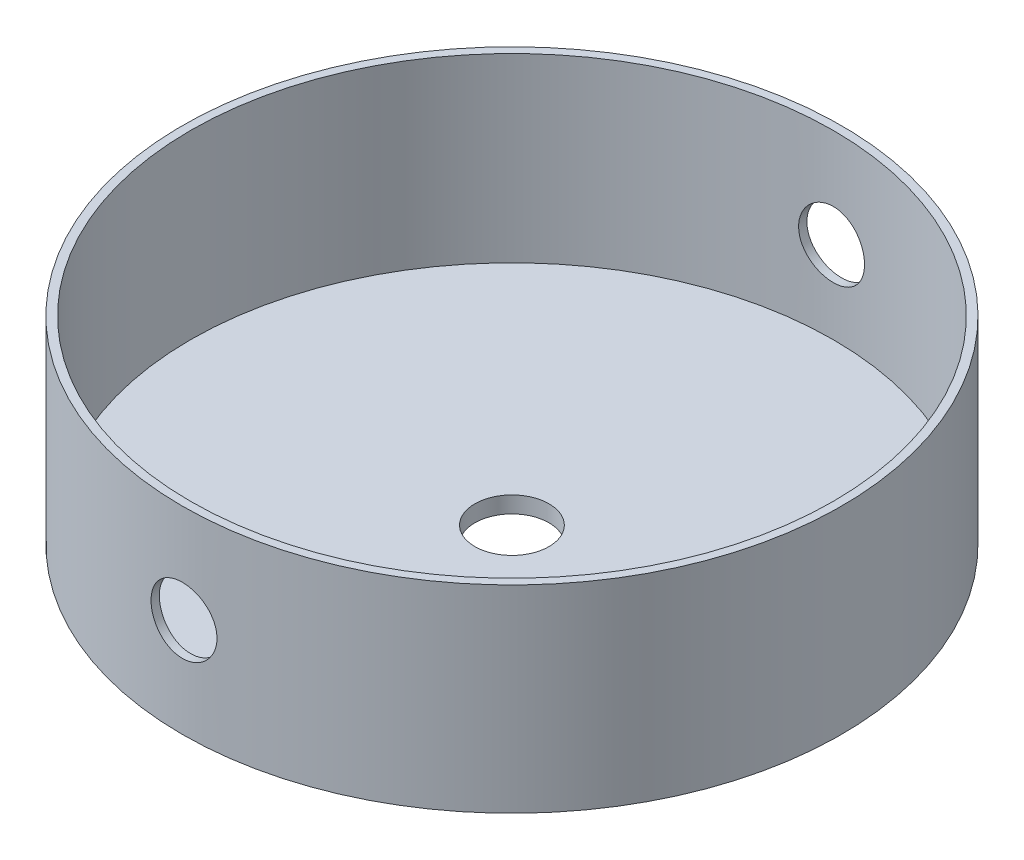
ISO-10303-21;
HEADER;
FILE_DESCRIPTION(('STEP AP214'),'2;1');
FILE_NAME('part.step','',(''),(''),'','','');
FILE_SCHEMA(('AUTOMOTIVE_DESIGN { 1 0 10303 214 1 1 1 1 }'));
ENDSEC;
DATA;
#1=APPLICATION_CONTEXT('core data for automotive mechanical design processes');
#2=APPLICATION_PROTOCOL_DEFINITION('international standard','automotive_design',2000,#1);
#3=PRODUCT_CONTEXT('',#1,'mechanical');
#4=PRODUCT('Part','Part','',(#3));
#5=PRODUCT_RELATED_PRODUCT_CATEGORY('part','',(#4));
#6=PRODUCT_DEFINITION_FORMATION('','',#4);
#7=PRODUCT_DEFINITION_CONTEXT('part definition',#1,'design');
#8=PRODUCT_DEFINITION('design','',#6,#7);
#9=PRODUCT_DEFINITION_SHAPE('','',#8);
#10=(LENGTH_UNIT() NAMED_UNIT(*) SI_UNIT(.MILLI.,.METRE.));
#11=(NAMED_UNIT(*) PLANE_ANGLE_UNIT() SI_UNIT($,.RADIAN.));
#12=(NAMED_UNIT(*) SI_UNIT($,.STERADIAN.) SOLID_ANGLE_UNIT());
#13=UNCERTAINTY_MEASURE_WITH_UNIT(LENGTH_MEASURE(1.E-05),#10,'distance_accuracy_value','');
#14=(GEOMETRIC_REPRESENTATION_CONTEXT(3) GLOBAL_UNCERTAINTY_ASSIGNED_CONTEXT((#13)) GLOBAL_UNIT_ASSIGNED_CONTEXT((#10,
#11,#12)) REPRESENTATION_CONTEXT('',''));
#15=CARTESIAN_POINT('',(0.,0.,0.));
#16=DIRECTION('',(0.,0.,1.));
#17=DIRECTION('',(1.,0.,0.));
#18=AXIS2_PLACEMENT_3D('',#15,#16,#17);
#19=CARTESIAN_POINT('',(0.,2.,0.));
#20=DIRECTION('',(0.,-1.,0.));
#21=DIRECTION('',(0.,0.,-1.));
#22=AXIS2_PLACEMENT_3D('',#19,#20,#21);
#23=CYLINDRICAL_SURFACE('',#22,40.);
#24=CARTESIAN_POINT('',(0.,16.,-40.));
#25=CARTESIAN_POINT('',(-0.224081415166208,15.9999902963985,-39.9999974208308));
#26=CARTESIAN_POINT('',(-0.448310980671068,15.9811069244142,-39.9980970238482));
#27=CARTESIAN_POINT('',(-0.890553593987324,15.9060625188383,-39.9906987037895));
#28=CARTESIAN_POINT('',(-1.10855951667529,15.8498604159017,-39.985196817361));
#29=CARTESIAN_POINT('',(-1.53188670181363,15.7018310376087,-39.9712165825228));
#30=CARTESIAN_POINT('',(-1.73721553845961,15.6100252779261,-39.9627400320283));
#31=CARTESIAN_POINT('',(-2.12950464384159,15.3934363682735,-39.9437582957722));
#32=CARTESIAN_POINT('',(-2.31646855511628,15.2686597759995,-39.9332535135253));
#33=CARTESIAN_POINT('',(-2.66743820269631,14.989189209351,-39.9113497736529));
#34=CARTESIAN_POINT('',(-2.83136857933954,14.8344008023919,-39.8999480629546));
#35=CARTESIAN_POINT('',(-3.1309700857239,14.4995018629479,-39.8775582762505));
#36=CARTESIAN_POINT('',(-3.26663990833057,14.3193901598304,-39.8665702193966));
#37=CARTESIAN_POINT('',(-3.50613588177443,13.9384858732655,-39.8462236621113));
#38=CARTESIAN_POINT('',(-3.6098938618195,13.7376502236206,-39.8368686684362));
#39=CARTESIAN_POINT('',(-3.782185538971,13.3212976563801,-39.820881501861));
#40=CARTESIAN_POINT('',(-3.8507201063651,13.1057811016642,-39.8142492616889));
#41=CARTESIAN_POINT('',(-3.95039616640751,12.666952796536,-39.8044833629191));
#42=CARTESIAN_POINT('',(-3.98166261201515,12.4436696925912,-39.8013380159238));
#43=CARTESIAN_POINT('',(-4.00630114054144,11.9950045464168,-39.798865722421));
#44=CARTESIAN_POINT('',(-3.9996742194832,11.7696225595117,-39.7995386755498));
#45=CARTESIAN_POINT('',(-3.94881712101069,11.3240187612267,-39.8046162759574));
#46=CARTESIAN_POINT('',(-3.90472337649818,11.1037812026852,-39.809007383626));
#47=CARTESIAN_POINT('',(-3.78039657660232,10.6738481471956,-39.8210053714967));
#48=CARTESIAN_POINT('',(-3.70016303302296,10.4641527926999,-39.8286122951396));
#49=CARTESIAN_POINT('',(-3.505683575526,10.0608256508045,-39.8462003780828));
#50=CARTESIAN_POINT('',(-3.39137713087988,9.86722324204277,-39.8561857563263));
#51=CARTESIAN_POINT('',(-3.13204010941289,9.50189914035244,-39.8774020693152));
#52=CARTESIAN_POINT('',(-2.98700863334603,9.33017808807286,-39.8886330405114));
#53=CARTESIAN_POINT('',(-2.66957644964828,9.01269842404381,-39.9111354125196));
#54=CARTESIAN_POINT('',(-2.49705791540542,8.86705759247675,-39.9224067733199));
#55=CARTESIAN_POINT('',(-2.1299579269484,8.60678546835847,-39.9436731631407));
#56=CARTESIAN_POINT('',(-1.93537644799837,8.49215421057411,-39.9536681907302));
#57=CARTESIAN_POINT('',(-1.52959242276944,8.29715991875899,-39.9712590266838));
#58=CARTESIAN_POINT('',(-1.31838698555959,8.21680286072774,-39.9788544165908));
#59=CARTESIAN_POINT('',(-0.885388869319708,8.09272433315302,-39.9907858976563));
#60=CARTESIAN_POINT('',(-0.663596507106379,8.04900176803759,-39.9951220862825));
#61=CARTESIAN_POINT('',(-0.216740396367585,7.99958276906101,-40.0000340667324));
#62=CARTESIAN_POINT('',(0.00830520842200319,7.99372380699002,-40.0006259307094));
#63=CARTESIAN_POINT('',(0.456175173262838,8.01977145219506,-39.9980256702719));
#64=CARTESIAN_POINT('',(0.678999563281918,8.05167754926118,-39.9948335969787));
#65=CARTESIAN_POINT('',(1.11563282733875,8.15221478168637,-39.9850344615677));
#66=CARTESIAN_POINT('',(1.32945939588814,8.22076981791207,-39.9784344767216));
#67=CARTESIAN_POINT('',(1.74257728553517,8.39258069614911,-39.9625599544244));
#68=CARTESIAN_POINT('',(1.9418682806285,8.49583731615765,-39.9532853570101));
#69=CARTESIAN_POINT('',(2.32099272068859,8.73452335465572,-39.9330590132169));
#70=CARTESIAN_POINT('',(2.50075863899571,8.87005955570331,-39.9221017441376));
#71=CARTESIAN_POINT('',(2.83504649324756,9.16930427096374,-39.8997573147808));
#72=CARTESIAN_POINT('',(2.98956779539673,9.33301349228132,-39.8883701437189));
#73=CARTESIAN_POINT('',(3.26954443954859,9.68466629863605,-39.8664009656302));
#74=CARTESIAN_POINT('',(3.39489311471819,9.87269502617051,-39.855822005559));
#75=CARTESIAN_POINT('',(3.61223303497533,10.2672294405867,-39.8367132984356));
#76=CARTESIAN_POINT('',(3.70422473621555,10.4737348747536,-39.8281835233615));
#77=CARTESIAN_POINT('',(3.85206083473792,10.8989949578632,-39.814157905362));
#78=CARTESIAN_POINT('',(3.90796869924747,11.1177273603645,-39.8086567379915));
#79=CARTESIAN_POINT('',(3.98225602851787,11.5615327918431,-39.8012946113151));
#80=CARTESIAN_POINT('',(4.00063656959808,11.7866056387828,-39.7994335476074));
#81=CARTESIAN_POINT('',(3.99933255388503,12.2356427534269,-39.7995645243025));
#82=CARTESIAN_POINT('',(3.97981555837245,12.4596075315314,-39.8015396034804));
#83=CARTESIAN_POINT('',(3.90362181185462,12.9010596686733,-39.8090841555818));
#84=CARTESIAN_POINT('',(3.84694501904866,13.118547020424,-39.8146536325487));
#85=CARTESIAN_POINT('',(3.69808674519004,13.5408693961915,-39.8287547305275));
#86=CARTESIAN_POINT('',(3.60591017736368,13.7457061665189,-39.8372859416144));
#87=CARTESIAN_POINT('',(3.38868621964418,14.1370275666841,-39.8563500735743));
#88=CARTESIAN_POINT('',(3.26363901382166,14.3235122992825,-39.866882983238));
#89=CARTESIAN_POINT('',(2.98359422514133,14.6736946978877,-39.8888194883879));
#90=CARTESIAN_POINT('',(2.82847179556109,14.8372923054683,-39.90022658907));
#91=CARTESIAN_POINT('',(2.49292679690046,15.1362089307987,-39.9225941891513));
#92=CARTESIAN_POINT('',(2.31249817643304,15.2715211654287,-39.933554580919));
#93=CARTESIAN_POINT('',(1.93096573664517,15.5102938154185,-39.9538224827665));
#94=CARTESIAN_POINT('',(1.72981099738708,15.6136731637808,-39.9631257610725));
#95=CARTESIAN_POINT('',(1.31303311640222,15.7850496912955,-39.9789851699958));
#96=CARTESIAN_POINT('',(1.09742659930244,15.8530867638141,-39.9855443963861));
#97=CARTESIAN_POINT('',(0.733833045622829,15.9348824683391,-39.9935285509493));
#98=CARTESIAN_POINT('',(0.588170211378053,15.9592681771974,-39.9959440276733));
#99=CARTESIAN_POINT('',(0.295026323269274,15.9918301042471,-39.9991805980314));
#100=CARTESIAN_POINT('',(0.147545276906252,16.0000063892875,-40.000001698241));
#101=CARTESIAN_POINT('',(0.,16.,-40.));
#102=B_SPLINE_CURVE_WITH_KNOTS('',3,(#24,#25,#26,#27,#28,#29,#30,#31,#32,#33,#34,#35,#36,#37,
#38,#39,#40,#41,#42,#43,#44,#45,#46,#47,#48,#49,#50,#51,#52,#53,#54,#55,#56,#57,#58,#59,#60,#61,
#62,#63,#64,#65,#66,#67,#68,#69,#70,#71,#72,#73,#74,#75,#76,#77,#78,#79,#80,#81,#82,#83,#84,#85,
#86,#87,#88,#89,#90,#91,#92,#93,#94,#95,#96,#97,#98,#99,#100,#101),.UNSPECIFIED.,.T.,.F.,(4,2,2,
2,2,2,2,2,2,2,2,2,2,2,2,2,2,2,2,2,2,2,2,2,2,2,2,2,2,2,2,2,2,2,2,2,2,2,4),(0.,0.671705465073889,
1.34415137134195,2.0161915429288,2.68809815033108,3.36215427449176,4.03624156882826,
4.71175901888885,5.3872597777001,6.06048928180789,6.73370109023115,7.40447189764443,
8.07525176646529,8.7472304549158,9.41922881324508,10.0941893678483,10.7691506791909,
11.4442296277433,12.1192883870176,12.7914475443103,13.4635976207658,14.1343574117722,
14.8051322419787,15.478157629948,16.1511999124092,16.8266657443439,17.5021223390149,
18.1763876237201,18.8506335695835,19.5219051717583,20.1931775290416,20.864357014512,
21.5355327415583,22.2095566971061,22.8837421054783,23.5596252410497,24.2347437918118,
24.6770266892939,25.119307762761),.UNSPECIFIED.);
#103=CARTESIAN_POINT('',(0.,16.,-40.));
#104=VERTEX_POINT('',#103);
#105=EDGE_CURVE('E92',#104,#104,#102,.T.);
#106=ORIENTED_EDGE('',*,*,#105,.T.);
#107=EDGE_LOOP('',(#106));
#108=FACE_BOUND('',#107,.T.);
#109=CARTESIAN_POINT('',(4.00000000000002,12.,39.7994974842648));
#110=CARTESIAN_POINT('',(3.99999029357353,11.7759217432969,39.7995001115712));
#111=CARTESIAN_POINT('',(3.98110743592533,11.5516953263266,39.8014102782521));
#112=CARTESIAN_POINT('',(3.9060652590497,11.1094592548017,39.8088435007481));
#113=CARTESIAN_POINT('',(3.84986485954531,10.8914567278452,39.8143705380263));
#114=CARTESIAN_POINT('',(3.70184046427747,10.4681367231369,39.8284053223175));
#115=CARTESIAN_POINT('',(3.61003806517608,10.2628116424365,39.8369112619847));
#116=CARTESIAN_POINT('',(3.39345706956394,9.87052883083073,39.8559432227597));
#117=CARTESIAN_POINT('',(3.26868502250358,9.68356746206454,39.8664688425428));
#118=CARTESIAN_POINT('',(2.98921904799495,9.33259494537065,39.8883970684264));
#119=CARTESIAN_POINT('',(2.83442967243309,9.16865996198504,39.8998024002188));
#120=CARTESIAN_POINT('',(2.49952686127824,8.86904956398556,39.9221802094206));
#121=CARTESIAN_POINT('',(2.31941226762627,8.73337544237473,39.9331526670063));
#122=CARTESIAN_POINT('',(1.93850544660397,8.49387497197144,39.9534553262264));
#123=CARTESIAN_POINT('',(1.73767065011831,8.39011600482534,39.9627820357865));
#124=CARTESIAN_POINT('',(1.32131993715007,8.2178222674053,39.9787126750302));
#125=CARTESIAN_POINT('',(1.10580437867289,8.14928663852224,39.9853166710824));
#126=CARTESIAN_POINT('',(0.666979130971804,8.04960836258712,39.9950386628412));
#127=CARTESIAN_POINT('',(0.443698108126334,8.01834066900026,39.9981683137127));
#128=CARTESIAN_POINT('',(-0.00496296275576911,7.99369892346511,40.0006286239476));
#129=CARTESIAN_POINT('',(-0.230342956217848,8.00032388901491,39.9999593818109));
#130=CARTESIAN_POINT('',(-0.675955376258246,8.05117789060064,39.9949068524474));
#131=CARTESIAN_POINT('',(-0.896203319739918,8.09527246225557,39.9905368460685));
#132=CARTESIAN_POINT('',(-1.32615671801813,8.21960451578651,39.9785891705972));
#133=CARTESIAN_POINT('',(-1.53586203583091,8.29984246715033,39.9710114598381));
#134=CARTESIAN_POINT('',(-1.93920125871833,8.49433105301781,39.9534774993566));
#135=CARTESIAN_POINT('',(-2.13280628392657,8.60864119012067,39.9435170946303));
#136=CARTESIAN_POINT('',(-2.49813405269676,8.86798609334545,39.9223353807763));
#137=CARTESIAN_POINT('',(-2.66985615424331,9.01302176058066,39.9111140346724));
#138=CARTESIAN_POINT('',(-2.98733108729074,9.3304569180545,39.8886117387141));
#139=CARTESIAN_POINT('',(-3.13296698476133,9.50297337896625,39.8773307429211));
#140=CARTESIAN_POINT('',(-3.3932301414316,9.87006746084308,39.8560295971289));
#141=CARTESIAN_POINT('',(-3.50785735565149,10.0646451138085,39.8460094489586));
#142=CARTESIAN_POINT('',(-3.70284873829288,10.4704281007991,39.828363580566));
#143=CARTESIAN_POINT('',(-3.78320568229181,10.6816369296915,39.8207383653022));
#144=CARTESIAN_POINT('',(-3.90728294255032,11.1146424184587,39.8087560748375));
#145=CARTESIAN_POINT('',(-3.95100437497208,11.3364387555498,39.8043989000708));
#146=CARTESIAN_POINT('',(-4.00041910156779,11.783296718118,39.7994632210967));
#147=CARTESIAN_POINT('',(-4.00627598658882,12.0083400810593,39.7988684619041));
#148=CARTESIAN_POINT('',(-3.98022498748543,12.4562050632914,39.8014820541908));
#149=CARTESIAN_POINT('',(-3.94831761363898,12.6790267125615,39.8046903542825));
#150=CARTESIAN_POINT('',(-3.84778069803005,13.1156463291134,39.8145337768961));
#151=CARTESIAN_POINT('',(-3.77922850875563,13.3294622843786,39.8211616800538));
#152=CARTESIAN_POINT('',(-3.60742687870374,13.7425602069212,39.8370916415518));
#153=CARTESIAN_POINT('',(-3.5041766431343,13.9418418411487,39.8463937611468));
#154=CARTESIAN_POINT('',(-3.26550000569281,14.3209598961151,39.8666633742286));
#155=CARTESIAN_POINT('',(-3.12996519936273,14.500727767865,39.8776364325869));
#156=CARTESIAN_POINT('',(-2.8307221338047,14.8350202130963,39.8999933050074));
#157=CARTESIAN_POINT('',(-2.66701317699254,14.9895441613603,39.9113771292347));
#158=CARTESIAN_POINT('',(-2.31535921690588,15.2695265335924,39.9333219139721));
#159=CARTESIAN_POINT('',(-2.12732902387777,15.3948782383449,39.943879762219));
#160=CARTESIAN_POINT('',(-1.73279086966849,15.6122234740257,39.9629376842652));
#161=CARTESIAN_POINT('',(-1.5262831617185,15.7042174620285,39.9714377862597));
#162=CARTESIAN_POINT('',(-1.10102450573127,15.8520550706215,39.9854084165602));
#163=CARTESIAN_POINT('',(-0.882296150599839,15.9079631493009,39.9908843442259));
#164=CARTESIAN_POINT('',(-0.438499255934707,15.9822522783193,39.998211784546));
#165=CARTESIAN_POINT('',(-0.213430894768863,16.000634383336,40.0000633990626));
#166=CARTESIAN_POINT('',(0.235608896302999,15.9993349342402,39.9999335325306));
#167=CARTESIAN_POINT('',(0.459580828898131,15.9798190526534,39.9979687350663));
#168=CARTESIAN_POINT('',(0.901047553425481,15.9036250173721,39.9904597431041));
#169=CARTESIAN_POINT('',(1.1185423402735,15.846946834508,39.9849155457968));
#170=CARTESIAN_POINT('',(1.54087963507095,15.6980829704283,39.9708689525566));
#171=CARTESIAN_POINT('',(1.74572386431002,15.6059021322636,39.962366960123));
#172=CARTESIAN_POINT('',(2.13705840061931,15.3886673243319,39.9433524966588));
#173=CARTESIAN_POINT('',(2.32354881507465,15.2636135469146,39.9328400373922));
#174=CARTESIAN_POINT('',(2.67373089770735,14.9835615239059,39.9109273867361));
#175=CARTESIAN_POINT('',(2.83732370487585,14.8284399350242,39.8995236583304));
#176=CARTESIAN_POINT('',(3.13623103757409,14.4928985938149,39.8771436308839));
#177=CARTESIAN_POINT('',(3.27153876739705,14.3124727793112,39.8661674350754));
#178=CARTESIAN_POINT('',(3.5103065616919,13.930942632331,39.8458553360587));
#179=CARTESIAN_POINT('',(3.6136847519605,13.7297868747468,39.8365236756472));
#180=CARTESIAN_POINT('',(3.78505883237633,13.3130068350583,39.8206077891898));
#181=CARTESIAN_POINT('',(3.85309463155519,13.0973991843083,39.8140204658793));
#182=CARTESIAN_POINT('',(3.93488675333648,12.7338090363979,39.806000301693));
#183=CARTESIAN_POINT('',(3.95927084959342,12.5881509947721,39.8035732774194));
#184=CARTESIAN_POINT('',(3.99183063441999,12.2950167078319,39.8003210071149));
#185=CARTESIAN_POINT('',(4.00000639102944,12.1475404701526,39.7994957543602));
#186=CARTESIAN_POINT('',(4.00000000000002,12.,39.7994974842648));
#187=B_SPLINE_CURVE_WITH_KNOTS('',3,(#109,#110,#111,#112,#113,#114,#115,#116,#117,#118,#119,
#120,#121,#122,#123,#124,#125,#126,#127,#128,#129,#130,#131,#132,#133,#134,#135,#136,#137,#138,
#139,#140,#141,#142,#143,#144,#145,#146,#147,#148,#149,#150,#151,#152,#153,#154,#155,#156,#157,
#158,#159,#160,#161,#162,#163,#164,#165,#166,#167,#168,#169,#170,#171,#172,#173,#174,#175,#176,
#177,#178,#179,#180,#181,#182,#183,#184,#185,#186),.UNSPECIFIED.,.T.,.F.,(4,2,2,2,2,2,2,2,2,2,2,
2,2,2,2,2,2,2,2,2,2,2,2,2,2,2,2,2,2,2,2,2,2,2,2,2,2,2,4),(0.,0.671695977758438,1.34413260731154,
2.01616196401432,2.68805792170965,3.36212646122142,4.03622583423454,4.71173879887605,
5.38723529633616,6.06045883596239,6.73366491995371,7.40446527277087,8.07527433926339,
8.74726181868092,9.41926900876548,10.0942170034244,10.7691659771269,11.4442571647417,
12.1193277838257,12.791479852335,13.4636228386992,14.1343525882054,14.8050977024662,
15.4781275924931,16.1511741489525,16.8266454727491,17.5021075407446,18.1763597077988,
18.8505929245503,19.5218853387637,20.1931782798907,20.8643796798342,21.5355771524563,
22.2095886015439,22.8837618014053,23.5596496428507,24.2347725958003,24.6770411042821,
25.1193077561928),.UNSPECIFIED.);
#188=CARTESIAN_POINT('',(4.00000000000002,12.,39.7994974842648));
#189=VERTEX_POINT('',#188);
#190=EDGE_CURVE('E86',#189,#189,#187,.T.);
#191=ORIENTED_EDGE('',*,*,#190,.T.);
#192=EDGE_LOOP('',(#191));
#193=FACE_BOUND('',#192,.T.);
#194=CARTESIAN_POINT('',(0.,0.,0.));
#195=DIRECTION('',(0.,1.,0.));
#196=DIRECTION('',(0.,0.,1.));
#197=AXIS2_PLACEMENT_3D('',#194,#195,#196);
#198=CIRCLE('',#197,40.);
#199=CARTESIAN_POINT('',(0.,0.,40.));
#200=VERTEX_POINT('',#199);
#201=EDGE_CURVE('E57',#200,#200,#198,.T.);
#202=ORIENTED_EDGE('',*,*,#201,.T.);
#203=EDGE_LOOP('',(#202));
#204=FACE_BOUND('',#203,.T.);
#205=CARTESIAN_POINT('',(0.,24.,0.));
#206=DIRECTION('',(0.,1.,0.));
#207=DIRECTION('',(0.,0.,1.));
#208=AXIS2_PLACEMENT_3D('',#205,#206,#207);
#209=CIRCLE('',#208,40.);
#210=CARTESIAN_POINT('',(0.,24.,40.));
#211=VERTEX_POINT('',#210);
#212=EDGE_CURVE('E62',#211,#211,#209,.T.);
#213=ORIENTED_EDGE('',*,*,#212,.F.);
#214=EDGE_LOOP('',(#213));
#215=FACE_BOUND('',#214,.T.);
#216=ADVANCED_FACE('F44',(#108,#193,#204,#215),#23,.T.);
#217=CARTESIAN_POINT('',(0.,0.,0.));
#218=DIRECTION('',(0.,1.,0.));
#219=DIRECTION('',(0.,0.,1.));
#220=AXIS2_PLACEMENT_3D('',#217,#218,#219);
#221=PLANE('',#220);
#222=CARTESIAN_POINT('',(0.,0.,0.));
#223=DIRECTION('',(0.,1.,0.));
#224=DIRECTION('',(0.,0.,1.));
#225=AXIS2_PLACEMENT_3D('',#222,#223,#224);
#226=CIRCLE('',#225,4.5);
#227=CARTESIAN_POINT('',(0.,0.,4.5));
#228=VERTEX_POINT('',#227);
#229=EDGE_CURVE('E70',#228,#228,#226,.T.);
#230=ORIENTED_EDGE('',*,*,#229,.T.);
#231=EDGE_LOOP('',(#230));
#232=FACE_BOUND('',#231,.T.);
#233=ORIENTED_EDGE('',*,*,#201,.F.);
#234=EDGE_LOOP('',(#233));
#235=FACE_BOUND('',#234,.T.);
#236=ADVANCED_FACE('F108',(#232,#235),#221,.F.);
#237=CARTESIAN_POINT('',(0.,24.,0.));
#238=DIRECTION('',(0.,1.,0.));
#239=DIRECTION('',(0.,0.,1.));
#240=AXIS2_PLACEMENT_3D('',#237,#238,#239);
#241=PLANE('',#240);
#242=ORIENTED_EDGE('',*,*,#212,.T.);
#243=EDGE_LOOP('',(#242));
#244=FACE_BOUND('',#243,.T.);
#245=CARTESIAN_POINT('',(0.,24.,0.));
#246=DIRECTION('',(0.,1.,0.));
#247=DIRECTION('',(0.,0.,1.));
#248=AXIS2_PLACEMENT_3D('',#245,#246,#247);
#249=CIRCLE('',#248,39.);
#250=CARTESIAN_POINT('',(0.,24.,39.));
#251=VERTEX_POINT('',#250);
#252=EDGE_CURVE('E99',#251,#251,#249,.T.);
#253=ORIENTED_EDGE('',*,*,#252,.F.);
#254=EDGE_LOOP('',(#253));
#255=FACE_BOUND('',#254,.T.);
#256=ADVANCED_FACE('F104',(#244,#255),#241,.T.);
#257=CARTESIAN_POINT('',(0.,24.,0.));
#258=DIRECTION('',(0.,-1.,0.));
#259=DIRECTION('',(0.,0.,-1.));
#260=AXIS2_PLACEMENT_3D('',#257,#258,#259);
#261=CYLINDRICAL_SURFACE('',#260,39.);
#262=CARTESIAN_POINT('',(0.,16.,-39.));
#263=CARTESIAN_POINT('',(-0.224050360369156,15.9999903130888,-38.9999973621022));
#264=CARTESIAN_POINT('',(-0.448248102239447,15.9811121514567,-38.9980487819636));
#265=CARTESIAN_POINT('',(-0.890425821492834,15.9060896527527,-38.9904628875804));
#266=CARTESIAN_POINT('',(-1.10839870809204,15.8499044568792,-38.9848215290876));
#267=CARTESIAN_POINT('',(-1.53165968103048,15.7019225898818,-38.9704867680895));
#268=CARTESIAN_POINT('',(-1.73695542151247,15.6101476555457,-38.96179522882));
#269=CARTESIAN_POINT('',(-2.12918477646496,15.3936341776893,-38.9423314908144));
#270=CARTESIAN_POINT('',(-2.31612198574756,15.2689021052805,-38.9315597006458));
#271=CARTESIAN_POINT('',(-2.66707784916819,14.9895098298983,-38.9090962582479));
#272=CARTESIAN_POINT('',(-2.8310174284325,14.8347505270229,-38.897401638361));
#273=CARTESIAN_POINT('',(-3.13064461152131,14.4999083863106,-38.8744350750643));
#274=CARTESIAN_POINT('',(-3.26633089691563,14.3198243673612,-38.8631631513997));
#275=CARTESIAN_POINT('',(-3.50588139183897,13.9389478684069,-38.8422880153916));
#276=CARTESIAN_POINT('',(-3.60967379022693,13.7381099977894,-38.8326885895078));
#277=CARTESIAN_POINT('',(-3.78203168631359,13.3217413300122,-38.8162823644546));
#278=CARTESIAN_POINT('',(-3.85059809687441,13.1062109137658,-38.8094754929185));
#279=CARTESIAN_POINT('',(-3.95032264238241,12.6673832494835,-38.7994520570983));
#280=CARTESIAN_POINT('',(-3.98161217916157,12.4441161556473,-38.7962228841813));
#281=CARTESIAN_POINT('',(-4.0063010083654,11.9954778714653,-38.793681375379));
#282=CARTESIAN_POINT('',(-3.99970134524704,11.7701067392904,-38.7943689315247));
#283=CARTESIAN_POINT('',(-3.94890737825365,11.3245645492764,-38.7995716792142));
#284=CARTESIAN_POINT('',(-3.90485666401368,11.1043769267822,-38.8040722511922));
#285=CARTESIAN_POINT('',(-3.78063451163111,10.6745365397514,-38.8163710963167));
#286=CARTESIAN_POINT('',(-3.70046256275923,10.4648839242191,-38.8241694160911));
#287=CARTESIAN_POINT('',(-3.50611561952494,10.0616119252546,-38.842201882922));
#288=CARTESIAN_POINT('',(-3.3918770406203,9.86802339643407,-38.8524405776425));
#289=CARTESIAN_POINT('',(-3.13268532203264,9.50271251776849,-38.8741963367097));
#290=CARTESIAN_POINT('',(-2.98773123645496,9.33099084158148,-38.8857134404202));
#291=CARTESIAN_POINT('',(-2.67042180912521,9.01345390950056,-38.9087934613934));
#292=CARTESIAN_POINT('',(-2.49794248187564,8.86776251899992,-38.9203563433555));
#293=CARTESIAN_POINT('',(-2.13090881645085,8.60738225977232,-38.9421746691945));
#294=CARTESIAN_POINT('',(-1.93635445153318,8.49269342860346,-38.9524301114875));
#295=CARTESIAN_POINT('',(-1.53060667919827,8.29757838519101,-38.9704816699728));
#296=CARTESIAN_POINT('',(-1.31941016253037,8.21715859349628,-38.9782773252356));
#297=CARTESIAN_POINT('',(-0.886414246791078,8.09295592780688,-38.9905262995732));
#298=CARTESIAN_POINT('',(-0.66461518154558,8.04917190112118,-38.9949797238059));
#299=CARTESIAN_POINT('',(-0.217782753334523,7.99964108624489,-39.0000289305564));
#300=CARTESIAN_POINT('',(0.007231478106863,7.99372340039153,-39.0006420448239));
#301=CARTESIAN_POINT('',(0.455048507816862,8.0196441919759,-38.9979880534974));
#302=CARTESIAN_POINT('',(0.677851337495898,8.05148213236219,-38.9947210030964));
#303=CARTESIAN_POINT('',(1.11442673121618,8.15186861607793,-38.9846848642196));
#304=CARTESIAN_POINT('',(1.32821791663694,8.22033700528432,-38.9779234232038));
#305=CARTESIAN_POINT('',(1.7412804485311,8.3919583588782,-38.9616568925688));
#306=CARTESIAN_POINT('',(1.94055145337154,8.49511213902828,-38.9521517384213));
#307=CARTESIAN_POINT('',(2.31968886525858,8.73359898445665,-38.9314174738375));
#308=CARTESIAN_POINT('',(2.49948441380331,8.86904417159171,-38.9201824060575));
#309=CARTESIAN_POINT('',(2.83384957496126,9.16810847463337,-38.8972677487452));
#310=CARTESIAN_POINT('',(2.98841852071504,9.33172833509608,-38.8855881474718));
#311=CARTESIAN_POINT('',(3.26853741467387,9.68324376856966,-38.8630485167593));
#312=CARTESIAN_POINT('',(3.39397509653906,9.87122904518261,-38.8521917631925));
#313=CARTESIAN_POINT('',(3.61149862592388,10.265697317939,-38.832577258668));
#314=CARTESIAN_POINT('',(3.70358494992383,10.4721800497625,-38.8238194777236));
#315=CARTESIAN_POINT('',(3.85160439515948,10.8973990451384,-38.809415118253));
#316=CARTESIAN_POINT('',(3.90760398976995,11.1161119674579,-38.8037628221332));
#317=CARTESIAN_POINT('',(3.98207589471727,11.5598973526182,-38.7961917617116));
#318=CARTESIAN_POINT('',(4.00054934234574,11.7849696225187,-38.7942728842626));
#319=CARTESIAN_POINT('',(3.99942830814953,12.2339687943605,-38.7943883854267));
#320=CARTESIAN_POINT('',(3.98001018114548,12.4578961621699,-38.7964044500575));
#321=CARTESIAN_POINT('',(3.90402731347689,12.8992894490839,-38.8041235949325));
#322=CARTESIAN_POINT('',(3.84746253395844,13.1167553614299,-38.8098266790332));
#323=CARTESIAN_POINT('',(3.69884130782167,13.5390492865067,-38.8242721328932));
#324=CARTESIAN_POINT('',(3.60679035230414,13.7438792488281,-38.8330140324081));
#325=CARTESIAN_POINT('',(3.38982782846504,14.1352100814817,-38.8525530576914));
#326=CARTESIAN_POINT('',(3.26491638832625,14.3217110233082,-38.8633501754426));
#327=CARTESIAN_POINT('',(2.98511694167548,14.6719934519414,-38.8858432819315));
#328=CARTESIAN_POINT('',(2.83009747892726,14.8356696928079,-38.8975430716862));
#329=CARTESIAN_POINT('',(2.4947445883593,15.1347621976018,-38.9204886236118));
#330=CARTESIAN_POINT('',(2.31440511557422,15.2701716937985,-38.931734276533));
#331=CARTESIAN_POINT('',(1.9330089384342,15.5091700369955,-38.9525354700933));
#332=CARTESIAN_POINT('',(1.7318989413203,15.6126741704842,-38.9620864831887));
#333=CARTESIAN_POINT('',(1.31518235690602,15.7843046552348,-38.9783734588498));
#334=CARTESIAN_POINT('',(1.09959236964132,15.852470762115,-38.9851125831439));
#335=CARTESIAN_POINT('',(0.73565932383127,15.9345553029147,-38.9933294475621));
#336=CARTESIAN_POINT('',(0.589640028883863,15.9590633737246,-38.9958191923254));
#337=CARTESIAN_POINT('',(0.295768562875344,15.9917888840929,-38.9991553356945));
#338=CARTESIAN_POINT('',(0.147916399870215,16.0000063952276,-39.0000017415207));
#339=CARTESIAN_POINT('',(0.,16.,-39.));
#340=B_SPLINE_CURVE_WITH_KNOTS('',3,(#262,#263,#264,#265,#266,#267,#268,#269,#270,#271,#272,
#273,#274,#275,#276,#277,#278,#279,#280,#281,#282,#283,#284,#285,#286,#287,#288,#289,#290,#291,
#292,#293,#294,#295,#296,#297,#298,#299,#300,#301,#302,#303,#304,#305,#306,#307,#308,#309,#310,
#311,#312,#313,#314,#315,#316,#317,#318,#319,#320,#321,#322,#323,#324,#325,#326,#327,#328,#329,
#330,#331,#332,#333,#334,#335,#336,#337,#338,#339),.UNSPECIFIED.,.T.,.F.,(4,2,2,2,2,2,2,2,2,2,2,
2,2,2,2,2,2,2,2,2,2,2,2,2,2,2,2,2,2,2,2,2,2,2,2,2,2,2,4),(0.,0.671610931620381,1.34395862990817,
2.01589633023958,2.6877021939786,3.36176416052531,4.03585757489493,4.71145781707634,
5.38704055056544,6.0602347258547,6.73341034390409,7.40401654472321,8.07463222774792,
8.74650751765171,9.41840350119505,10.0934161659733,10.7684296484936,11.4435695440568,
12.1186881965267,12.7907577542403,13.4628177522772,14.1334131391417,14.804024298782,
15.4769987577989,16.14999100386,16.8255353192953,17.5010699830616,18.1753566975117,
18.8496229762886,19.5207585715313,20.191894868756,20.8629273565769,21.533957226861,
22.2079855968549,22.8821751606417,23.5581396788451,24.2333420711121,24.6767366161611,
25.1201292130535),.UNSPECIFIED.);
#341=CARTESIAN_POINT('',(0.,16.,-39.));
#342=VERTEX_POINT('',#341);
#343=EDGE_CURVE('E48',#342,#342,#340,.T.);
#344=ORIENTED_EDGE('',*,*,#343,.F.);
#345=EDGE_LOOP('',(#344));
#346=FACE_BOUND('',#345,.T.);
#347=CARTESIAN_POINT('',(4.00000000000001,12.,38.7943294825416));
#348=CARTESIAN_POINT('',(3.9999903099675,11.7759531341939,38.7943321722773));
#349=CARTESIAN_POINT('',(3.98111271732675,11.5517588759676,38.7962912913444));
#350=CARTESIAN_POINT('',(3.9060926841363,11.1095883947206,38.8039148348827));
#351=CARTESIAN_POINT('',(3.8499093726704,10.8916192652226,38.8095833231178));
#352=CARTESIAN_POINT('',(3.7019330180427,10.4683662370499,38.823976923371));
#353=CARTESIAN_POINT('',(3.61016180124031,10.2630746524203,38.8327001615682));
#354=CARTESIAN_POINT('',(3.39365707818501,9.87085226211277,38.8522180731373));
#355=CARTESIAN_POINT('',(3.26893003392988,9.68391786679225,38.8630123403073));
#356=CARTESIAN_POINT('',(2.9895428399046,9.33295883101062,38.8855022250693));
#357=CARTESIAN_POINT('',(2.83478246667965,9.16901415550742,38.8972007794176));
#358=CARTESIAN_POINT('',(2.49993604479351,8.86937713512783,38.9201544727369));
#359=CARTESIAN_POINT('',(2.31984882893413,8.73368609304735,38.9314095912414));
#360=CARTESIAN_POINT('',(1.93896952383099,8.4941306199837,38.9522373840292));
#361=CARTESIAN_POINT('',(1.73813259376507,8.39033712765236,38.9618062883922));
#362=CARTESIAN_POINT('',(1.32176597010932,8.21797694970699,38.978151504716));
#363=CARTESIAN_POINT('',(1.10623665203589,8.14940936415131,38.9849278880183));
#364=CARTESIAN_POINT('',(0.667412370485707,8.04968236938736,38.9949039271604));
#365=CARTESIAN_POINT('',(0.444147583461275,8.01839145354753,38.9981161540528));
#366=CARTESIAN_POINT('',(-0.00448618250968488,7.99369906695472,39.0006447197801));
#367=CARTESIAN_POINT('',(-0.229855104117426,8.00029656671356,38.9999611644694));
#368=CARTESIAN_POINT('',(-0.675406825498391,8.05108710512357,38.9947854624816));
#369=CARTESIAN_POINT('',(-0.895605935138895,8.09513873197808,38.9903076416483));
#370=CARTESIAN_POINT('',(-1.32546882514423,8.21936668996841,38.9780630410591));
#371=CARTESIAN_POINT('',(-1.53513246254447,8.29954351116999,38.9702962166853));
#372=CARTESIAN_POINT('',(-1.93841783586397,8.49390055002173,38.952322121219));
#373=CARTESIAN_POINT('',(-2.13200926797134,8.60814321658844,38.942110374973));
#374=CARTESIAN_POINT('',(-2.49732422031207,8.86734366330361,38.9203919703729));
#375=CARTESIAN_POINT('',(-2.66904706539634,9.01230239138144,38.9088852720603));
#376=CARTESIAN_POINT('',(-2.98657876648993,9.32961511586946,38.8858054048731));
#377=CARTESIAN_POINT('',(-3.13226469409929,9.50209214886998,38.8742321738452));
#378=CARTESIAN_POINT('',(-3.39263502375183,9.86911927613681,38.8523764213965));
#379=CARTESIAN_POINT('',(-3.50731937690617,10.0636694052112,38.8420939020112));
#380=CARTESIAN_POINT('',(-3.70243119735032,10.4694160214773,38.8239829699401));
#381=CARTESIAN_POINT('',(-3.78285086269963,10.6806162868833,38.8161551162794));
#382=CARTESIAN_POINT('',(-3.90705212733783,11.1136203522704,38.803851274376));
#383=CARTESIAN_POINT('',(-3.95083490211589,11.3354238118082,38.7993751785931));
#384=CARTESIAN_POINT('',(-4.00036099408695,11.7822582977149,38.7943003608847));
#385=CARTESIAN_POINT('',(-4.00627638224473,12.0072700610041,38.7936840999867));
#386=CARTESIAN_POINT('',(-3.98035187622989,12.4550816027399,38.7963524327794));
#387=CARTESIAN_POINT('',(-3.94851251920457,12.6778814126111,38.7996369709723));
#388=CARTESIAN_POINT('',(-3.84812637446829,13.1144417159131,38.8097208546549));
#389=CARTESIAN_POINT('',(-3.77966112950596,13.3282211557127,38.8165123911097));
#390=CARTESIAN_POINT('',(-3.60804999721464,13.7412615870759,38.8328386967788));
#391=CARTESIAN_POINT('',(-3.5049032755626,13.9405222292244,38.8423735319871));
#392=CARTESIAN_POINT('',(-3.26642683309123,14.319652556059,38.8631545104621));
#393=CARTESIAN_POINT('',(-3.13098319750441,14.4994502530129,38.8744066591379));
#394=CARTESIAN_POINT('',(-2.8319207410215,14.833820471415,38.8973348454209));
#395=CARTESIAN_POINT('',(-2.668301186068,14.9883923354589,38.9090108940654));
#396=CARTESIAN_POINT('',(-2.31678448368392,15.2685175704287,38.931524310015));
#397=CARTESIAN_POINT('',(-2.12879757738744,15.3939586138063,38.9423583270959));
#398=CARTESIAN_POINT('',(-1.73432514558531,15.6114880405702,38.9619180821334));
#399=CARTESIAN_POINT('',(-1.52783988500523,15.7035769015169,38.9706438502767));
#400=CARTESIAN_POINT('',(-1.10262245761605,15.8515980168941,38.9849888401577));
#401=CARTESIAN_POINT('',(-0.88391401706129,15.9075978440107,38.9906138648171));
#402=CARTESIAN_POINT('',(-0.44013808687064,15.9820717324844,38.9981474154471));
#403=CARTESIAN_POINT('',(-0.215070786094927,16.00054690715,39.0000560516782));
#404=CARTESIAN_POINT('',(0.233931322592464,15.9994309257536,38.9999416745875));
#405=CARTESIAN_POINT('',(0.457866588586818,15.9800140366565,38.997936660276));
#406=CARTESIAN_POINT('',(0.899275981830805,15.904030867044,38.9902558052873));
#407=CARTESIAN_POINT('',(1.11675010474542,15.8474645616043,38.9845799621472));
#408=CARTESIAN_POINT('',(1.53906054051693,15.6988371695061,38.9701932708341));
#409=CARTESIAN_POINT('',(1.74389877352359,15.606781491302,38.9614828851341));
#410=CARTESIAN_POINT('',(2.13524417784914,15.3898069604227,38.9419974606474));
#411=CARTESIAN_POINT('',(2.32175142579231,15.2648882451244,38.9312224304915));
#412=CARTESIAN_POINT('',(2.67203353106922,14.9850807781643,38.9087551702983));
#413=CARTESIAN_POINT('',(2.8357044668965,14.8300622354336,38.8970591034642));
#414=CARTESIAN_POINT('',(3.13478669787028,14.4947133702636,38.8741003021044));
#415=CARTESIAN_POINT('',(3.27019121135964,14.3143769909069,38.8628376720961));
#416=CARTESIAN_POINT('',(3.50918417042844,13.9329833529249,38.8419888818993));
#417=CARTESIAN_POINT('',(3.61268701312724,13.7318722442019,38.8324072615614));
#418=CARTESIAN_POINT('',(3.78431477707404,13.315153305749,38.8160593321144));
#419=CARTESIAN_POINT('',(3.85247947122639,13.0995620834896,38.8092898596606));
#420=CARTESIAN_POINT('',(3.93456004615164,12.7356328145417,38.8010340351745));
#421=CARTESIAN_POINT('',(3.95906633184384,12.5896188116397,38.7985317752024));
#422=CARTESIAN_POINT('',(3.99178947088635,12.2957579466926,38.7951786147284));
#423=CARTESIAN_POINT('',(4.00000639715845,12.1479110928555,38.7943277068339));
#424=CARTESIAN_POINT('',(4.00000000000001,12.,38.7943294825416));
#425=B_SPLINE_CURVE_WITH_KNOTS('',3,(#347,#348,#349,#350,#351,#352,#353,#354,#355,#356,#357,
#358,#359,#360,#361,#362,#363,#364,#365,#366,#367,#368,#369,#370,#371,#372,#373,#374,#375,#376,
#377,#378,#379,#380,#381,#382,#383,#384,#385,#386,#387,#388,#389,#390,#391,#392,#393,#394,#395,
#396,#397,#398,#399,#400,#401,#402,#403,#404,#405,#406,#407,#408,#409,#410,#411,#412,#413,#414,
#415,#416,#417,#418,#419,#420,#421,#422,#423,#424),.UNSPECIFIED.,.T.,.F.,(4,2,2,2,2,2,2,2,2,2,2,
2,2,2,2,2,2,2,2,2,2,2,2,2,2,2,2,2,2,2,2,2,2,2,2,2,2,2,4),(0.,0.671600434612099,1.34393786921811,
2.01586360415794,2.68765768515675,3.3617333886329,4.03584016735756,4.71143545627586,
5.38701348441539,6.06020104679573,6.73337031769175,7.4040091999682,8.07465718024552,
8.74654221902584,9.41844799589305,10.0934467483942,10.7684465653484,11.4435999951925,
12.118731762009,12.7907935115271,13.4628456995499,14.1334078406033,14.803986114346,
15.4769655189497,16.149962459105,16.8255128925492,17.5010536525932,18.1753258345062,
18.8495780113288,19.5207365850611,20.1918956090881,20.8629523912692,21.5340063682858,
22.2080209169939,22.8821969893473,23.5581666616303,24.233373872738,24.6767525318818,
25.1201292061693),.UNSPECIFIED.);
#426=CARTESIAN_POINT('',(4.00000000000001,12.,38.7943294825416));
#427=VERTEX_POINT('',#426);
#428=EDGE_CURVE('E65',#427,#427,#425,.T.);
#429=ORIENTED_EDGE('',*,*,#428,.F.);
#430=EDGE_LOOP('',(#429));
#431=FACE_BOUND('',#430,.T.);
#432=ORIENTED_EDGE('',*,*,#252,.T.);
#433=EDGE_LOOP('',(#432));
#434=FACE_BOUND('',#433,.T.);
#435=CARTESIAN_POINT('',(0.,2.,0.));
#436=DIRECTION('',(0.,1.,0.));
#437=DIRECTION('',(0.,0.,1.));
#438=AXIS2_PLACEMENT_3D('',#435,#436,#437);
#439=CIRCLE('',#438,39.);
#440=CARTESIAN_POINT('',(0.,2.,39.));
#441=VERTEX_POINT('',#440);
#442=EDGE_CURVE('E12',#441,#441,#439,.F.);
#443=ORIENTED_EDGE('',*,*,#442,.T.);
#444=EDGE_LOOP('',(#443));
#445=FACE_BOUND('',#444,.T.);
#446=ADVANCED_FACE('F71',(#346,#431,#434,#445),#261,.F.);
#447=CARTESIAN_POINT('',(0.,2.,0.));
#448=DIRECTION('',(0.,1.,0.));
#449=DIRECTION('',(0.,0.,1.));
#450=AXIS2_PLACEMENT_3D('',#447,#448,#449);
#451=PLANE('',#450);
#452=CARTESIAN_POINT('',(0.,2.,0.));
#453=DIRECTION('',(0.,1.,0.));
#454=DIRECTION('',(0.,0.,1.));
#455=AXIS2_PLACEMENT_3D('',#452,#453,#454);
#456=CIRCLE('',#455,4.5);
#457=CARTESIAN_POINT('',(0.,2.,4.5));
#458=VERTEX_POINT('',#457);
#459=EDGE_CURVE('E172',#458,#458,#456,.T.);
#460=ORIENTED_EDGE('',*,*,#459,.F.);
#461=EDGE_LOOP('',(#460));
#462=FACE_BOUND('',#461,.T.);
#463=ORIENTED_EDGE('',*,*,#442,.F.);
#464=EDGE_LOOP('',(#463));
#465=FACE_BOUND('',#464,.T.);
#466=ADVANCED_FACE('F122',(#462,#465),#451,.T.);
#467=CARTESIAN_POINT('',(0.,12.,-40.));
#468=DIRECTION('',(0.,0.,1.));
#469=DIRECTION('',(1.,0.,0.));
#470=AXIS2_PLACEMENT_3D('',#467,#468,#469);
#471=CYLINDRICAL_SURFACE('',#470,4.);
#472=ORIENTED_EDGE('',*,*,#428,.T.);
#473=EDGE_LOOP('',(#472));
#474=FACE_BOUND('',#473,.T.);
#475=ORIENTED_EDGE('',*,*,#190,.F.);
#476=EDGE_LOOP('',(#475));
#477=FACE_BOUND('',#476,.T.);
#478=ADVANCED_FACE('F79',(#474,#477),#471,.F.);
#479=ORIENTED_EDGE('',*,*,#343,.T.);
#480=EDGE_LOOP('',(#479));
#481=FACE_BOUND('',#480,.T.);
#482=ORIENTED_EDGE('',*,*,#105,.F.);
#483=EDGE_LOOP('',(#482));
#484=FACE_BOUND('',#483,.T.);
#485=ADVANCED_FACE('F74',(#481,#484),#471,.F.);
#486=CARTESIAN_POINT('',(0.,-20.,0.));
#487=DIRECTION('',(0.,1.,0.));
#488=DIRECTION('',(0.,0.,1.));
#489=AXIS2_PLACEMENT_3D('',#486,#487,#488);
#490=CYLINDRICAL_SURFACE('',#489,4.5);
#491=ORIENTED_EDGE('',*,*,#459,.T.);
#492=EDGE_LOOP('',(#491));
#493=FACE_BOUND('',#492,.T.);
#494=ORIENTED_EDGE('',*,*,#229,.F.);
#495=EDGE_LOOP('',(#494));
#496=FACE_BOUND('',#495,.T.);
#497=ADVANCED_FACE('F78',(#493,#496),#490,.F.);
#498=CLOSED_SHELL('',(#216,#236,#256,#446,#466,#478,#485,#497));
#499=MANIFOLD_SOLID_BREP('B2',#498);
#500=ADVANCED_BREP_SHAPE_REPRESENTATION('',(#18,#499),#14);
#501=SHAPE_DEFINITION_REPRESENTATION(#9,#500);
ENDSEC;
END-ISO-10303-21;
